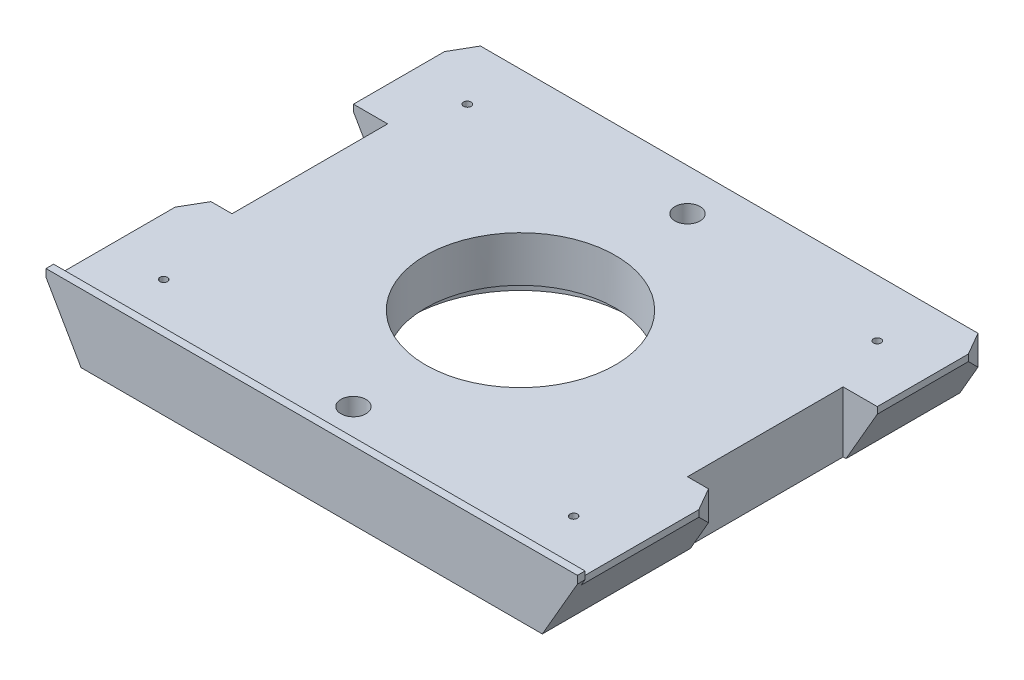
ISO-10303-21;
HEADER;
FILE_DESCRIPTION(('STEP AP214'),'2;1');
FILE_NAME('part.step','',(''),(''),'','','');
FILE_SCHEMA(('AUTOMOTIVE_DESIGN { 1 0 10303 214 1 1 1 1 }'));
ENDSEC;
DATA;
#1=APPLICATION_CONTEXT('core data for automotive mechanical design processes');
#2=APPLICATION_PROTOCOL_DEFINITION('international standard','automotive_design',2000,#1);
#3=PRODUCT_CONTEXT('',#1,'mechanical');
#4=PRODUCT('Part','Part','',(#3));
#5=PRODUCT_RELATED_PRODUCT_CATEGORY('part','',(#4));
#6=PRODUCT_DEFINITION_FORMATION('','',#4);
#7=PRODUCT_DEFINITION_CONTEXT('part definition',#1,'design');
#8=PRODUCT_DEFINITION('design','',#6,#7);
#9=PRODUCT_DEFINITION_SHAPE('','',#8);
#10=(LENGTH_UNIT() NAMED_UNIT(*) SI_UNIT(.MILLI.,.METRE.));
#11=(NAMED_UNIT(*) PLANE_ANGLE_UNIT() SI_UNIT($,.RADIAN.));
#12=(NAMED_UNIT(*) SI_UNIT($,.STERADIAN.) SOLID_ANGLE_UNIT());
#13=UNCERTAINTY_MEASURE_WITH_UNIT(LENGTH_MEASURE(1.E-05),#10,'distance_accuracy_value','');
#14=(GEOMETRIC_REPRESENTATION_CONTEXT(3) GLOBAL_UNCERTAINTY_ASSIGNED_CONTEXT((#13)) GLOBAL_UNIT_ASSIGNED_CONTEXT((#10,
#11,#12)) REPRESENTATION_CONTEXT('',''));
#15=CARTESIAN_POINT('',(0.,0.,0.));
#16=DIRECTION('',(0.,0.,1.));
#17=DIRECTION('',(1.,0.,0.));
#18=AXIS2_PLACEMENT_3D('',#15,#16,#17);
#19=CARTESIAN_POINT('',(0.,-4.,0.));
#20=DIRECTION('',(0.,1.,0.));
#21=DIRECTION('',(0.,0.,1.));
#22=AXIS2_PLACEMENT_3D('',#19,#20,#21);
#23=CYLINDRICAL_SURFACE('',#22,12.5);
#24=CARTESIAN_POINT('',(0.,4.,0.));
#25=DIRECTION('',(0.,1.,0.));
#26=DIRECTION('',(0.,0.,1.));
#27=AXIS2_PLACEMENT_3D('',#24,#25,#26);
#28=CIRCLE('',#27,12.5);
#29=CARTESIAN_POINT('',(0.,4.,12.5));
#30=VERTEX_POINT('',#29);
#31=EDGE_CURVE('E370',#30,#30,#28,.T.);
#32=ORIENTED_EDGE('',*,*,#31,.T.);
#33=EDGE_LOOP('',(#32));
#34=FACE_BOUND('',#33,.T.);
#35=CARTESIAN_POINT('',(0.,-2.,0.));
#36=DIRECTION('',(0.,-1.,0.));
#37=DIRECTION('',(0.,0.,-1.));
#38=AXIS2_PLACEMENT_3D('',#35,#36,#37);
#39=CIRCLE('',#38,12.5);
#40=CARTESIAN_POINT('',(0.,-2.,-12.5));
#41=VERTEX_POINT('',#40);
#42=EDGE_CURVE('E367',#41,#41,#39,.F.);
#43=ORIENTED_EDGE('',*,*,#42,.F.);
#44=EDGE_LOOP('',(#43));
#45=FACE_BOUND('',#44,.T.);
#46=ADVANCED_FACE('F50',(#34,#45),#23,.F.);
#47=CARTESIAN_POINT('',(30.3811978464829,-4.,-27.5));
#48=DIRECTION('',(-0.866025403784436,0.500000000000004,0.));
#49=DIRECTION('',(-0.500000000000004,-0.866025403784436,0.));
#50=AXIS2_PLACEMENT_3D('',#47,#48,#49);
#51=PLANE('',#50);
#52=DIRECTION('',(0.500000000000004,0.866025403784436,0.));
#53=VECTOR('',#52,1.);
#54=CARTESIAN_POINT('',(30.3811978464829,-4.00000000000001,8.));
#55=LINE('',#54,#53);
#56=CARTESIAN_POINT('',(30.3811978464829,-4.,8.));
#57=VERTEX_POINT('',#56);
#58=CARTESIAN_POINT('',(32.7679491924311,0.133974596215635,8.));
#59=VERTEX_POINT('',#58);
#60=EDGE_CURVE('E257',#57,#59,#55,.T.);
#61=ORIENTED_EDGE('',*,*,#60,.T.);
#62=DIRECTION('',(0.377964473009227,0.65465367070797,0.654653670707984));
#63=VECTOR('',#62,1.);
#64=CARTESIAN_POINT('',(22.6201193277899,-17.4425823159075,-9.57655691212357));
#65=LINE('',#64,#63);
#66=CARTESIAN_POINT('',(34.5,3.13397459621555,11.));
#67=VERTEX_POINT('',#66);
#68=EDGE_CURVE('E65',#59,#67,#65,.T.);
#69=ORIENTED_EDGE('',*,*,#68,.T.);
#70=DIRECTION('',(0.,0.,1.));
#71=VECTOR('',#70,1.);
#72=CARTESIAN_POINT('',(34.5,3.13397459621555,-28.5));
#73=LINE('',#72,#71);
#74=CARTESIAN_POINT('',(34.5,3.13397459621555,26.5));
#75=VERTEX_POINT('',#74);
#76=EDGE_CURVE('E326',#67,#75,#73,.T.);
#77=ORIENTED_EDGE('',*,*,#76,.T.);
#78=DIRECTION('',(-0.499999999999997,-0.86602540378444,0.));
#79=VECTOR('',#78,1.);
#80=CARTESIAN_POINT('',(34.5,3.13397459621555,26.5));
#81=LINE('',#80,#79);
#82=CARTESIAN_POINT('',(35.,4.,26.5));
#83=VERTEX_POINT('',#82);
#84=EDGE_CURVE('E320',#83,#75,#81,.T.);
#85=ORIENTED_EDGE('',*,*,#84,.F.);
#86=DIRECTION('',(0.,0.,-1.));
#87=VECTOR('',#86,1.);
#88=CARTESIAN_POINT('',(35.,4.,27.5));
#89=LINE('',#88,#87);
#90=CARTESIAN_POINT('',(35.,4.,27.5));
#91=VERTEX_POINT('',#90);
#92=EDGE_CURVE('E349',#91,#83,#89,.T.);
#93=ORIENTED_EDGE('',*,*,#92,.F.);
#94=DIRECTION('',(-0.500000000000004,-0.866025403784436,0.));
#95=VECTOR('',#94,1.);
#96=CARTESIAN_POINT('',(30.3811978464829,-4.,27.5));
#97=LINE('',#96,#95);
#98=CARTESIAN_POINT('',(30.3811978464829,-4.,27.5));
#99=VERTEX_POINT('',#98);
#100=EDGE_CURVE('E465',#91,#99,#97,.T.);
#101=ORIENTED_EDGE('',*,*,#100,.T.);
#102=DIRECTION('',(0.,0.,1.));
#103=VECTOR('',#102,1.);
#104=CARTESIAN_POINT('',(30.3811978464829,-4.,-27.5));
#105=LINE('',#104,#103);
#106=EDGE_CURVE('E447',#57,#99,#105,.T.);
#107=ORIENTED_EDGE('',*,*,#106,.F.);
#108=EDGE_LOOP('',(#61,#69,#77,#85,#93,#101,#107));
#109=FACE_BOUND('',#108,.T.);
#110=ADVANCED_FACE('F444',(#109),#51,.F.);
#111=CARTESIAN_POINT('',(34.5,4.,-28.5));
#112=DIRECTION('',(1.,0.,0.));
#113=DIRECTION('',(0.,0.,-1.));
#114=AXIS2_PLACEMENT_3D('',#111,#112,#113);
#115=PLANE('',#114);
#116=DIRECTION('',(0.,1.,0.));
#117=VECTOR('',#116,1.);
#118=CARTESIAN_POINT('',(34.5,-4.,11.));
#119=LINE('',#118,#117);
#120=CARTESIAN_POINT('',(34.5,4.,11.));
#121=VERTEX_POINT('',#120);
#122=EDGE_CURVE('E234',#67,#121,#119,.T.);
#123=ORIENTED_EDGE('',*,*,#122,.T.);
#124=DIRECTION('',(0.,0.,1.));
#125=VECTOR('',#124,1.);
#126=CARTESIAN_POINT('',(34.5,4.,-28.5));
#127=LINE('',#126,#125);
#128=CARTESIAN_POINT('',(34.5,4.,26.5));
#129=VERTEX_POINT('',#128);
#130=EDGE_CURVE('E233',#121,#129,#127,.T.);
#131=ORIENTED_EDGE('',*,*,#130,.T.);
#132=DIRECTION('',(0.,1.,0.));
#133=VECTOR('',#132,1.);
#134=CARTESIAN_POINT('',(34.5,4.,26.5));
#135=LINE('',#134,#133);
#136=EDGE_CURVE('E321',#75,#129,#135,.T.);
#137=ORIENTED_EDGE('',*,*,#136,.F.);
#138=ORIENTED_EDGE('',*,*,#76,.F.);
#139=EDGE_LOOP('',(#123,#131,#137,#138));
#140=FACE_BOUND('',#139,.T.);
#141=ADVANCED_FACE('F441',(#140),#115,.T.);
#142=CARTESIAN_POINT('',(-35.,4.,-27.5));
#143=DIRECTION('',(0.866025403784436,0.500000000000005,0.));
#144=DIRECTION('',(-0.500000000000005,0.866025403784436,0.));
#145=AXIS2_PLACEMENT_3D('',#142,#143,#144);
#146=PLANE('',#145);
#147=DIRECTION('',(0.,0.,1.));
#148=VECTOR('',#147,1.);
#149=CARTESIAN_POINT('',(-34.5,3.13397459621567,-28.5));
#150=LINE('',#149,#148);
#151=CARTESIAN_POINT('',(-34.5,3.13397459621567,-24.5));
#152=VERTEX_POINT('',#151);
#153=CARTESIAN_POINT('',(-34.5,3.13397459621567,-12.5));
#154=VERTEX_POINT('',#153);
#155=EDGE_CURVE('E315',#152,#154,#150,.T.);
#156=ORIENTED_EDGE('',*,*,#155,.F.);
#157=DIRECTION('',(0.377964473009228,-0.654653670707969,-0.654653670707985));
#158=VECTOR('',#157,1.);
#159=CARTESIAN_POINT('',(-34.0434067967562,2.34313196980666,-25.2908426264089));
#160=LINE('',#159,#158);
#161=CARTESIAN_POINT('',(-32.7679491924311,0.13397459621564,-27.5));
#162=VERTEX_POINT('',#161);
#163=EDGE_CURVE('E422',#152,#162,#160,.T.);
#164=ORIENTED_EDGE('',*,*,#163,.T.);
#165=DIRECTION('',(-0.500000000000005,0.866025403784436,0.));
#166=VECTOR('',#165,1.);
#167=CARTESIAN_POINT('',(-35.,4.,-27.5));
#168=LINE('',#167,#166);
#169=CARTESIAN_POINT('',(-30.3811978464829,-4.,-27.5));
#170=VERTEX_POINT('',#169);
#171=EDGE_CURVE('E461',#170,#162,#168,.T.);
#172=ORIENTED_EDGE('',*,*,#171,.F.);
#173=DIRECTION('',(0.,0.,1.));
#174=VECTOR('',#173,1.);
#175=CARTESIAN_POINT('',(-30.3811978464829,-4.,-27.5));
#176=LINE('',#175,#174);
#177=CARTESIAN_POINT('',(-30.3811978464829,-4.,-12.5));
#178=VERTEX_POINT('',#177);
#179=EDGE_CURVE('E470',#170,#178,#176,.T.);
#180=ORIENTED_EDGE('',*,*,#179,.T.);
#181=DIRECTION('',(-0.500000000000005,0.866025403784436,0.));
#182=VECTOR('',#181,1.);
#183=CARTESIAN_POINT('',(-35.,4.,-12.5));
#184=LINE('',#183,#182);
#185=EDGE_CURVE('E283',#178,#154,#184,.T.);
#186=ORIENTED_EDGE('',*,*,#185,.T.);
#187=EDGE_LOOP('',(#156,#164,#172,#180,#186));
#188=FACE_BOUND('',#187,.T.);
#189=ADVANCED_FACE('F512',(#188),#146,.F.);
#190=CARTESIAN_POINT('',(-34.5,4.,-28.5));
#191=DIRECTION('',(-1.,0.,0.));
#192=DIRECTION('',(0.,0.,1.));
#193=AXIS2_PLACEMENT_3D('',#190,#191,#192);
#194=PLANE('',#193);
#195=DIRECTION('',(0.,1.,0.));
#196=VECTOR('',#195,1.);
#197=CARTESIAN_POINT('',(-34.5,-4.,-24.5));
#198=LINE('',#197,#196);
#199=CARTESIAN_POINT('',(-34.5,4.,-24.5));
#200=VERTEX_POINT('',#199);
#201=EDGE_CURVE('E425',#152,#200,#198,.T.);
#202=ORIENTED_EDGE('',*,*,#201,.F.);
#203=ORIENTED_EDGE('',*,*,#155,.T.);
#204=DIRECTION('',(0.,-1.,0.));
#205=VECTOR('',#204,1.);
#206=CARTESIAN_POINT('',(-34.5,4.,-12.5));
#207=LINE('',#206,#205);
#208=CARTESIAN_POINT('',(-34.5,4.,-12.5));
#209=VERTEX_POINT('',#208);
#210=EDGE_CURVE('E359',#209,#154,#207,.T.);
#211=ORIENTED_EDGE('',*,*,#210,.F.);
#212=DIRECTION('',(0.,0.,1.));
#213=VECTOR('',#212,1.);
#214=CARTESIAN_POINT('',(-34.5,4.,-28.5));
#215=LINE('',#214,#213);
#216=EDGE_CURVE('E318',#200,#209,#215,.T.);
#217=ORIENTED_EDGE('',*,*,#216,.F.);
#218=EDGE_LOOP('',(#202,#203,#211,#217));
#219=FACE_BOUND('',#218,.T.);
#220=ADVANCED_FACE('F519',(#219),#194,.T.);
#221=CARTESIAN_POINT('',(35.,4.,27.5));
#222=DIRECTION('',(0.,-1.,0.));
#223=DIRECTION('',(0.,0.,-1.));
#224=AXIS2_PLACEMENT_3D('',#221,#222,#223);
#225=PLANE('',#224);
#226=CARTESIAN_POINT('',(0.,4.,-22.));
#227=DIRECTION('',(0.,1.,0.));
#228=DIRECTION('',(0.,0.,1.));
#229=AXIS2_PLACEMENT_3D('',#226,#227,#228);
#230=CIRCLE('',#229,1.64999999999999);
#231=CARTESIAN_POINT('',(0.,4.,-20.35));
#232=VERTEX_POINT('',#231);
#233=EDGE_CURVE('E419',#232,#232,#230,.T.);
#234=ORIENTED_EDGE('',*,*,#233,.F.);
#235=EDGE_LOOP('',(#234));
#236=FACE_BOUND('',#235,.T.);
#237=CARTESIAN_POINT('',(0.,4.,22.));
#238=DIRECTION('',(0.,1.,0.));
#239=DIRECTION('',(0.,0.,1.));
#240=AXIS2_PLACEMENT_3D('',#237,#238,#239);
#241=CIRCLE('',#240,1.64999999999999);
#242=CARTESIAN_POINT('',(0.,4.,23.65));
#243=VERTEX_POINT('',#242);
#244=EDGE_CURVE('E413',#243,#243,#241,.T.);
#245=ORIENTED_EDGE('',*,*,#244,.F.);
#246=EDGE_LOOP('',(#245));
#247=FACE_BOUND('',#246,.T.);
#248=ORIENTED_EDGE('',*,*,#31,.F.);
#249=EDGE_LOOP('',(#248));
#250=FACE_BOUND('',#249,.T.);
#251=CARTESIAN_POINT('',(-27.,4.,-20.));
#252=DIRECTION('',(0.,1.,0.));
#253=DIRECTION('',(0.,0.,1.));
#254=AXIS2_PLACEMENT_3D('',#251,#252,#253);
#255=CIRCLE('',#254,0.5);
#256=CARTESIAN_POINT('',(-27.,4.,-19.5));
#257=VERTEX_POINT('',#256);
#258=EDGE_CURVE('E286',#257,#257,#255,.T.);
#259=ORIENTED_EDGE('',*,*,#258,.F.);
#260=EDGE_LOOP('',(#259));
#261=FACE_BOUND('',#260,.T.);
#262=CARTESIAN_POINT('',(27.,4.,-20.));
#263=DIRECTION('',(0.,1.,0.));
#264=DIRECTION('',(0.,0.,1.));
#265=AXIS2_PLACEMENT_3D('',#262,#263,#264);
#266=CIRCLE('',#265,0.5);
#267=CARTESIAN_POINT('',(27.,4.,-19.5));
#268=VERTEX_POINT('',#267);
#269=EDGE_CURVE('E292',#268,#268,#266,.T.);
#270=ORIENTED_EDGE('',*,*,#269,.F.);
#271=EDGE_LOOP('',(#270));
#272=FACE_BOUND('',#271,.T.);
#273=CARTESIAN_POINT('',(27.,4.,20.));
#274=DIRECTION('',(0.,1.,0.));
#275=DIRECTION('',(0.,0.,1.));
#276=AXIS2_PLACEMENT_3D('',#273,#274,#275);
#277=CIRCLE('',#276,0.5);
#278=CARTESIAN_POINT('',(27.,4.,20.5));
#279=VERTEX_POINT('',#278);
#280=EDGE_CURVE('E298',#279,#279,#277,.T.);
#281=ORIENTED_EDGE('',*,*,#280,.F.);
#282=EDGE_LOOP('',(#281));
#283=FACE_BOUND('',#282,.T.);
#284=CARTESIAN_POINT('',(-27.,4.,20.));
#285=DIRECTION('',(0.,1.,0.));
#286=DIRECTION('',(0.,0.,1.));
#287=AXIS2_PLACEMENT_3D('',#284,#285,#286);
#288=CIRCLE('',#287,0.5);
#289=CARTESIAN_POINT('',(-27.,4.,20.5));
#290=VERTEX_POINT('',#289);
#291=EDGE_CURVE('E304',#290,#290,#288,.T.);
#292=ORIENTED_EDGE('',*,*,#291,.F.);
#293=EDGE_LOOP('',(#292));
#294=FACE_BOUND('',#293,.T.);
#295=ORIENTED_EDGE('',*,*,#130,.F.);
#296=DIRECTION('',(0.499999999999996,0.,0.866025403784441));
#297=VECTOR('',#296,1.);
#298=CARTESIAN_POINT('',(32.7679491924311,4.,8.));
#299=LINE('',#298,#297);
#300=CARTESIAN_POINT('',(32.7679491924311,4.,8.));
#301=VERTEX_POINT('',#300);
#302=EDGE_CURVE('E221',#301,#121,#299,.T.);
#303=ORIENTED_EDGE('',*,*,#302,.F.);
#304=DIRECTION('',(1.,0.,0.));
#305=VECTOR('',#304,1.);
#306=CARTESIAN_POINT('',(34.5,4.,8.));
#307=LINE('',#306,#305);
#308=CARTESIAN_POINT('',(30.,4.,8.));
#309=VERTEX_POINT('',#308);
#310=EDGE_CURVE('E231',#309,#301,#307,.T.);
#311=ORIENTED_EDGE('',*,*,#310,.F.);
#312=DIRECTION('',(0.,0.,1.));
#313=VECTOR('',#312,1.);
#314=CARTESIAN_POINT('',(30.,4.,-12.5));
#315=LINE('',#314,#313);
#316=CARTESIAN_POINT('',(30.,4.,-12.5));
#317=VERTEX_POINT('',#316);
#318=EDGE_CURVE('E241',#317,#309,#315,.T.);
#319=ORIENTED_EDGE('',*,*,#318,.F.);
#320=DIRECTION('',(-1.,0.,0.));
#321=VECTOR('',#320,1.);
#322=CARTESIAN_POINT('',(34.5,4.,-12.5));
#323=LINE('',#322,#321);
#324=CARTESIAN_POINT('',(34.5,4.,-12.5));
#325=VERTEX_POINT('',#324);
#326=EDGE_CURVE('E246',#325,#317,#323,.T.);
#327=ORIENTED_EDGE('',*,*,#326,.F.);
#328=CARTESIAN_POINT('',(34.5,4.,-24.5));
#329=VERTEX_POINT('',#328);
#330=EDGE_CURVE('E324',#329,#325,#127,.T.);
#331=ORIENTED_EDGE('',*,*,#330,.F.);
#332=DIRECTION('',(0.499999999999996,0.,0.866025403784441));
#333=VECTOR('',#332,1.);
#334=CARTESIAN_POINT('',(32.7679491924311,4.,-27.5));
#335=LINE('',#334,#333);
#336=CARTESIAN_POINT('',(32.7679491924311,4.,-27.5));
#337=VERTEX_POINT('',#336);
#338=EDGE_CURVE('E72',#337,#329,#335,.T.);
#339=ORIENTED_EDGE('',*,*,#338,.F.);
#340=DIRECTION('',(-1.,0.,0.));
#341=VECTOR('',#340,1.);
#342=CARTESIAN_POINT('',(35.,4.,-27.5));
#343=LINE('',#342,#341);
#344=CARTESIAN_POINT('',(-32.7679491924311,4.,-27.5));
#345=VERTEX_POINT('',#344);
#346=EDGE_CURVE('E363',#337,#345,#343,.T.);
#347=ORIENTED_EDGE('',*,*,#346,.T.);
#348=DIRECTION('',(0.499999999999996,0.,-0.866025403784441));
#349=VECTOR('',#348,1.);
#350=CARTESIAN_POINT('',(-34.5,4.,-24.5));
#351=LINE('',#350,#349);
#352=EDGE_CURVE('E427',#200,#345,#351,.T.);
#353=ORIENTED_EDGE('',*,*,#352,.F.);
#354=ORIENTED_EDGE('',*,*,#216,.T.);
#355=DIRECTION('',(-1.,0.,0.));
#356=VECTOR('',#355,1.);
#357=CARTESIAN_POINT('',(-34.5,4.,-12.5));
#358=LINE('',#357,#356);
#359=CARTESIAN_POINT('',(-30.,4.,-12.5));
#360=VERTEX_POINT('',#359);
#361=EDGE_CURVE('E264',#360,#209,#358,.T.);
#362=ORIENTED_EDGE('',*,*,#361,.F.);
#363=DIRECTION('',(0.,0.,-1.));
#364=VECTOR('',#363,1.);
#365=CARTESIAN_POINT('',(-30.,4.,-12.5));
#366=LINE('',#365,#364);
#367=CARTESIAN_POINT('',(-30.,4.,8.));
#368=VERTEX_POINT('',#367);
#369=EDGE_CURVE('E272',#368,#360,#366,.T.);
#370=ORIENTED_EDGE('',*,*,#369,.F.);
#371=DIRECTION('',(1.,0.,0.));
#372=VECTOR('',#371,1.);
#373=CARTESIAN_POINT('',(-34.5,4.,8.));
#374=LINE('',#373,#372);
#375=CARTESIAN_POINT('',(-32.7679491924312,4.,8.));
#376=VERTEX_POINT('',#375);
#377=EDGE_CURVE('E259',#376,#368,#374,.T.);
#378=ORIENTED_EDGE('',*,*,#377,.F.);
#379=DIRECTION('',(0.499999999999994,0.,-0.866025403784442));
#380=VECTOR('',#379,1.);
#381=CARTESIAN_POINT('',(-32.7679491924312,4.,8.));
#382=LINE('',#381,#380);
#383=CARTESIAN_POINT('',(-34.5,4.,11.));
#384=VERTEX_POINT('',#383);
#385=EDGE_CURVE('E389',#384,#376,#382,.T.);
#386=ORIENTED_EDGE('',*,*,#385,.F.);
#387=CARTESIAN_POINT('',(-34.5,4.,26.5));
#388=VERTEX_POINT('',#387);
#389=EDGE_CURVE('E317',#384,#388,#215,.T.);
#390=ORIENTED_EDGE('',*,*,#389,.T.);
#391=DIRECTION('',(-1.,0.,0.));
#392=VECTOR('',#391,1.);
#393=CARTESIAN_POINT('',(-35.,4.,26.5));
#394=LINE('',#393,#392);
#395=EDGE_CURVE('E334',#129,#388,#394,.T.);
#396=ORIENTED_EDGE('',*,*,#395,.F.);
#397=EDGE_LOOP('',(#295,#303,#311,#319,#327,#331,#339,#347,#353,#354,#362,#370,#378,#386,#390,#396));
#398=FACE_BOUND('',#397,.T.);
#399=ADVANCED_FACE('F229',(#236,#247,#250,#261,#272,#283,#294,#398),#225,.F.);
#400=CARTESIAN_POINT('',(35.,-4.,-27.5));
#401=DIRECTION('',(0.,0.,1.));
#402=DIRECTION('',(1.,0.,0.));
#403=AXIS2_PLACEMENT_3D('',#400,#401,#402);
#404=PLANE('',#403);
#405=ORIENTED_EDGE('',*,*,#346,.F.);
#406=DIRECTION('',(0.,1.,0.));
#407=VECTOR('',#406,1.);
#408=CARTESIAN_POINT('',(32.7679491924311,-4.,-27.5));
#409=LINE('',#408,#407);
#410=CARTESIAN_POINT('',(32.7679491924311,0.133974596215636,-27.5));
#411=VERTEX_POINT('',#410);
#412=EDGE_CURVE('E390',#411,#337,#409,.T.);
#413=ORIENTED_EDGE('',*,*,#412,.F.);
#414=DIRECTION('',(-0.500000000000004,-0.866025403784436,0.));
#415=VECTOR('',#414,1.);
#416=CARTESIAN_POINT('',(30.3811978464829,-4.,-27.5));
#417=LINE('',#416,#415);
#418=CARTESIAN_POINT('',(30.3811978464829,-4.,-27.5));
#419=VERTEX_POINT('',#418);
#420=EDGE_CURVE('E388',#411,#419,#417,.T.);
#421=ORIENTED_EDGE('',*,*,#420,.T.);
#422=DIRECTION('',(-1.,0.,0.));
#423=VECTOR('',#422,1.);
#424=CARTESIAN_POINT('',(35.,-4.,-27.5));
#425=LINE('',#424,#423);
#426=EDGE_CURVE('E458',#419,#170,#425,.T.);
#427=ORIENTED_EDGE('',*,*,#426,.T.);
#428=ORIENTED_EDGE('',*,*,#171,.T.);
#429=DIRECTION('',(0.,1.,0.));
#430=VECTOR('',#429,1.);
#431=CARTESIAN_POINT('',(-32.7679491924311,-4.,-27.5));
#432=LINE('',#431,#430);
#433=EDGE_CURVE('E366',#162,#345,#432,.T.);
#434=ORIENTED_EDGE('',*,*,#433,.T.);
#435=EDGE_LOOP('',(#405,#413,#421,#427,#428,#434));
#436=FACE_BOUND('',#435,.T.);
#437=ADVANCED_FACE('F52',(#436),#404,.F.);
#438=CARTESIAN_POINT('',(-34.5,3.13397459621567,11.));
#439=VERTEX_POINT('',#438);
#440=CARTESIAN_POINT('',(-34.5,3.13397459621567,26.5));
#441=VERTEX_POINT('',#440);
#442=EDGE_CURVE('E314',#439,#441,#150,.T.);
#443=ORIENTED_EDGE('',*,*,#442,.F.);
#444=DIRECTION('',(0.377964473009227,-0.654653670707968,-0.654653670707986));
#445=VECTOR('',#444,1.);
#446=CARTESIAN_POINT('',(-25.2594348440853,-12.8711537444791,-5.00512834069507));
#447=LINE('',#446,#445);
#448=CARTESIAN_POINT('',(-32.7679491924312,0.133974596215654,8.));
#449=VERTEX_POINT('',#448);
#450=EDGE_CURVE('E430',#439,#449,#447,.T.);
#451=ORIENTED_EDGE('',*,*,#450,.T.);
#452=DIRECTION('',(0.500000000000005,-0.866025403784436,0.));
#453=VECTOR('',#452,1.);
#454=CARTESIAN_POINT('',(-35.,4.,8.));
#455=LINE('',#454,#453);
#456=CARTESIAN_POINT('',(-30.3811978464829,-4.,8.));
#457=VERTEX_POINT('',#456);
#458=EDGE_CURVE('E279',#449,#457,#455,.T.);
#459=ORIENTED_EDGE('',*,*,#458,.T.);
#460=CARTESIAN_POINT('',(-30.3811978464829,-4.,27.5));
#461=VERTEX_POINT('',#460);
#462=EDGE_CURVE('E468',#457,#461,#176,.T.);
#463=ORIENTED_EDGE('',*,*,#462,.T.);
#464=DIRECTION('',(-0.500000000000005,0.866025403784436,0.));
#465=VECTOR('',#464,1.);
#466=CARTESIAN_POINT('',(-35.,4.,27.5));
#467=LINE('',#466,#465);
#468=CARTESIAN_POINT('',(-35.,4.,27.5));
#469=VERTEX_POINT('',#468);
#470=EDGE_CURVE('E459',#461,#469,#467,.T.);
#471=ORIENTED_EDGE('',*,*,#470,.T.);
#472=DIRECTION('',(0.,0.,1.));
#473=VECTOR('',#472,1.);
#474=CARTESIAN_POINT('',(-35.,4.,27.5));
#475=LINE('',#474,#473);
#476=CARTESIAN_POINT('',(-35.,4.,26.5));
#477=VERTEX_POINT('',#476);
#478=EDGE_CURVE('E329',#477,#469,#475,.T.);
#479=ORIENTED_EDGE('',*,*,#478,.F.);
#480=DIRECTION('',(-0.500000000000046,0.866025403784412,0.));
#481=VECTOR('',#480,1.);
#482=CARTESIAN_POINT('',(-34.5,3.13397459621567,26.5));
#483=LINE('',#482,#481);
#484=EDGE_CURVE('E310',#441,#477,#483,.T.);
#485=ORIENTED_EDGE('',*,*,#484,.F.);
#486=EDGE_LOOP('',(#443,#451,#459,#463,#471,#479,#485));
#487=FACE_BOUND('',#486,.T.);
#488=ADVANCED_FACE('F536',(#487),#146,.F.);
#489=CARTESIAN_POINT('',(35.,-4.,27.5));
#490=DIRECTION('',(0.,0.,-1.));
#491=DIRECTION('',(-1.,0.,0.));
#492=AXIS2_PLACEMENT_3D('',#489,#490,#491);
#493=PLANE('',#492);
#494=DIRECTION('',(-1.,0.,0.));
#495=VECTOR('',#494,1.);
#496=CARTESIAN_POINT('',(35.,-4.,27.5));
#497=LINE('',#496,#495);
#498=EDGE_CURVE('E474',#99,#461,#497,.T.);
#499=ORIENTED_EDGE('',*,*,#498,.F.);
#500=ORIENTED_EDGE('',*,*,#100,.F.);
#501=DIRECTION('',(0.,-1.,0.));
#502=VECTOR('',#501,1.);
#503=CARTESIAN_POINT('',(35.,5.,27.5));
#504=LINE('',#503,#502);
#505=CARTESIAN_POINT('',(35.,5.,27.5));
#506=VERTEX_POINT('',#505);
#507=EDGE_CURVE('E343',#506,#91,#504,.T.);
#508=ORIENTED_EDGE('',*,*,#507,.F.);
#509=DIRECTION('',(1.,0.,0.));
#510=VECTOR('',#509,1.);
#511=CARTESIAN_POINT('',(-35.,5.,27.5));
#512=LINE('',#511,#510);
#513=CARTESIAN_POINT('',(-35.,5.,27.5));
#514=VERTEX_POINT('',#513);
#515=EDGE_CURVE('E333',#514,#506,#512,.T.);
#516=ORIENTED_EDGE('',*,*,#515,.F.);
#517=DIRECTION('',(0.,-1.,0.));
#518=VECTOR('',#517,1.);
#519=CARTESIAN_POINT('',(-35.,5.,27.5));
#520=LINE('',#519,#518);
#521=EDGE_CURVE('E494',#514,#469,#520,.T.);
#522=ORIENTED_EDGE('',*,*,#521,.T.);
#523=ORIENTED_EDGE('',*,*,#470,.F.);
#524=EDGE_LOOP('',(#499,#500,#508,#516,#522,#523));
#525=FACE_BOUND('',#524,.T.);
#526=ADVANCED_FACE('F551',(#525),#493,.F.);
#527=CARTESIAN_POINT('',(35.,-4.,27.5));
#528=DIRECTION('',(0.,1.,0.));
#529=DIRECTION('',(0.,0.,1.));
#530=AXIS2_PLACEMENT_3D('',#527,#528,#529);
#531=PLANE('',#530);
#532=CARTESIAN_POINT('',(0.,-4.,-22.));
#533=DIRECTION('',(0.,1.,0.));
#534=DIRECTION('',(0.,0.,1.));
#535=AXIS2_PLACEMENT_3D('',#532,#533,#534);
#536=CIRCLE('',#535,1.65);
#537=CARTESIAN_POINT('',(0.,-4.,-20.35));
#538=VERTEX_POINT('',#537);
#539=EDGE_CURVE('E416',#538,#538,#536,.T.);
#540=ORIENTED_EDGE('',*,*,#539,.T.);
#541=EDGE_LOOP('',(#540));
#542=FACE_BOUND('',#541,.T.);
#543=CARTESIAN_POINT('',(0.,-4.,22.));
#544=DIRECTION('',(0.,1.,0.));
#545=DIRECTION('',(0.,0.,1.));
#546=AXIS2_PLACEMENT_3D('',#543,#544,#545);
#547=CIRCLE('',#546,1.65);
#548=CARTESIAN_POINT('',(0.,-4.,23.65));
#549=VERTEX_POINT('',#548);
#550=EDGE_CURVE('E408',#549,#549,#547,.T.);
#551=ORIENTED_EDGE('',*,*,#550,.T.);
#552=EDGE_LOOP('',(#551));
#553=FACE_BOUND('',#552,.T.);
#554=CARTESIAN_POINT('',(0.,-4.,0.));
#555=DIRECTION('',(0.,-1.,0.));
#556=DIRECTION('',(0.,0.,-1.));
#557=AXIS2_PLACEMENT_3D('',#554,#555,#556);
#558=CIRCLE('',#557,14.5);
#559=CARTESIAN_POINT('',(0.,-4.,-14.5));
#560=VERTEX_POINT('',#559);
#561=EDGE_CURVE('E405',#560,#560,#558,.T.);
#562=ORIENTED_EDGE('',*,*,#561,.F.);
#563=EDGE_LOOP('',(#562));
#564=FACE_BOUND('',#563,.T.);
#565=DIRECTION('',(0.,0.,1.));
#566=VECTOR('',#565,1.);
#567=CARTESIAN_POINT('',(30.,-4.,-12.5));
#568=LINE('',#567,#566);
#569=CARTESIAN_POINT('',(30.,-4.,-12.5));
#570=VERTEX_POINT('',#569);
#571=CARTESIAN_POINT('',(30.,-4.,8.));
#572=VERTEX_POINT('',#571);
#573=EDGE_CURVE('E244',#570,#572,#568,.T.);
#574=ORIENTED_EDGE('',*,*,#573,.T.);
#575=DIRECTION('',(1.,0.,0.));
#576=VECTOR('',#575,1.);
#577=CARTESIAN_POINT('',(34.5,-4.,8.));
#578=LINE('',#577,#576);
#579=EDGE_CURVE('E254',#572,#57,#578,.T.);
#580=ORIENTED_EDGE('',*,*,#579,.T.);
#581=ORIENTED_EDGE('',*,*,#106,.T.);
#582=ORIENTED_EDGE('',*,*,#498,.T.);
#583=ORIENTED_EDGE('',*,*,#462,.F.);
#584=DIRECTION('',(1.,0.,0.));
#585=VECTOR('',#584,1.);
#586=CARTESIAN_POINT('',(-34.5,-4.,8.));
#587=LINE('',#586,#585);
#588=CARTESIAN_POINT('',(-30.,-4.,8.));
#589=VERTEX_POINT('',#588);
#590=EDGE_CURVE('E260',#457,#589,#587,.T.);
#591=ORIENTED_EDGE('',*,*,#590,.T.);
#592=DIRECTION('',(0.,0.,-1.));
#593=VECTOR('',#592,1.);
#594=CARTESIAN_POINT('',(-30.,-4.,-12.5));
#595=LINE('',#594,#593);
#596=CARTESIAN_POINT('',(-30.,-4.,-12.5));
#597=VERTEX_POINT('',#596);
#598=EDGE_CURVE('E263',#589,#597,#595,.T.);
#599=ORIENTED_EDGE('',*,*,#598,.T.);
#600=DIRECTION('',(-1.,0.,0.));
#601=VECTOR('',#600,1.);
#602=CARTESIAN_POINT('',(-34.5,-4.,-12.5));
#603=LINE('',#602,#601);
#604=EDGE_CURVE('E267',#597,#178,#603,.T.);
#605=ORIENTED_EDGE('',*,*,#604,.T.);
#606=ORIENTED_EDGE('',*,*,#179,.F.);
#607=ORIENTED_EDGE('',*,*,#426,.F.);
#608=CARTESIAN_POINT('',(30.3811978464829,-4.,-12.5));
#609=VERTEX_POINT('',#608);
#610=EDGE_CURVE('E455',#419,#609,#105,.T.);
#611=ORIENTED_EDGE('',*,*,#610,.T.);
#612=DIRECTION('',(-1.,0.,0.));
#613=VECTOR('',#612,1.);
#614=CARTESIAN_POINT('',(34.5,-4.,-12.5));
#615=LINE('',#614,#613);
#616=EDGE_CURVE('E240',#609,#570,#615,.T.);
#617=ORIENTED_EDGE('',*,*,#616,.T.);
#618=EDGE_LOOP('',(#574,#580,#581,#582,#583,#591,#599,#605,#606,#607,#611,#617));
#619=FACE_BOUND('',#618,.T.);
#620=ADVANCED_FACE('F449',(#542,#553,#564,#619),#531,.F.);
#621=ORIENTED_EDGE('',*,*,#420,.F.);
#622=DIRECTION('',(0.377964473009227,0.65465367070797,0.654653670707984));
#623=VECTOR('',#622,1.);
#624=CARTESIAN_POINT('',(31.4040912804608,-2.22829660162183,-29.8622711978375));
#625=LINE('',#624,#623);
#626=CARTESIAN_POINT('',(34.5,3.13397459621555,-24.5));
#627=VERTEX_POINT('',#626);
#628=EDGE_CURVE('E378',#411,#627,#625,.T.);
#629=ORIENTED_EDGE('',*,*,#628,.T.);
#630=CARTESIAN_POINT('',(34.5,3.13397459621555,-12.5));
#631=VERTEX_POINT('',#630);
#632=EDGE_CURVE('E327',#627,#631,#73,.T.);
#633=ORIENTED_EDGE('',*,*,#632,.T.);
#634=DIRECTION('',(-0.500000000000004,-0.866025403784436,0.));
#635=VECTOR('',#634,1.);
#636=CARTESIAN_POINT('',(30.3811978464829,-4.,-12.5));
#637=LINE('',#636,#635);
#638=EDGE_CURVE('E251',#631,#609,#637,.T.);
#639=ORIENTED_EDGE('',*,*,#638,.T.);
#640=ORIENTED_EDGE('',*,*,#610,.F.);
#641=EDGE_LOOP('',(#621,#629,#633,#639,#640));
#642=FACE_BOUND('',#641,.T.);
#643=ADVANCED_FACE('F385',(#642),#51,.F.);
#644=CARTESIAN_POINT('',(-35.,5.,27.5));
#645=DIRECTION('',(1.,0.,0.));
#646=DIRECTION('',(0.,0.,-1.));
#647=AXIS2_PLACEMENT_3D('',#644,#645,#646);
#648=PLANE('',#647);
#649=ORIENTED_EDGE('',*,*,#478,.T.);
#650=ORIENTED_EDGE('',*,*,#521,.F.);
#651=DIRECTION('',(0.,0.,1.));
#652=VECTOR('',#651,1.);
#653=CARTESIAN_POINT('',(-35.,5.,27.5));
#654=LINE('',#653,#652);
#655=CARTESIAN_POINT('',(-35.,5.,26.5));
#656=VERTEX_POINT('',#655);
#657=EDGE_CURVE('E330',#656,#514,#654,.T.);
#658=ORIENTED_EDGE('',*,*,#657,.F.);
#659=DIRECTION('',(0.,-1.,0.));
#660=VECTOR('',#659,1.);
#661=CARTESIAN_POINT('',(-35.,5.,26.5));
#662=LINE('',#661,#660);
#663=EDGE_CURVE('E340',#656,#477,#662,.T.);
#664=ORIENTED_EDGE('',*,*,#663,.T.);
#665=EDGE_LOOP('',(#649,#650,#658,#664));
#666=FACE_BOUND('',#665,.T.);
#667=ADVANCED_FACE('F553',(#666),#648,.F.);
#668=CARTESIAN_POINT('',(35.,5.,27.5));
#669=DIRECTION('',(-1.,0.,0.));
#670=DIRECTION('',(0.,0.,1.));
#671=AXIS2_PLACEMENT_3D('',#668,#669,#670);
#672=PLANE('',#671);
#673=ORIENTED_EDGE('',*,*,#92,.T.);
#674=DIRECTION('',(0.,-1.,0.));
#675=VECTOR('',#674,1.);
#676=CARTESIAN_POINT('',(35.,5.,26.5));
#677=LINE('',#676,#675);
#678=CARTESIAN_POINT('',(35.,5.,26.5));
#679=VERTEX_POINT('',#678);
#680=EDGE_CURVE('E479',#679,#83,#677,.T.);
#681=ORIENTED_EDGE('',*,*,#680,.F.);
#682=DIRECTION('',(0.,0.,-1.));
#683=VECTOR('',#682,1.);
#684=CARTESIAN_POINT('',(35.,5.,27.5));
#685=LINE('',#684,#683);
#686=EDGE_CURVE('E336',#506,#679,#685,.T.);
#687=ORIENTED_EDGE('',*,*,#686,.F.);
#688=ORIENTED_EDGE('',*,*,#507,.T.);
#689=EDGE_LOOP('',(#673,#681,#687,#688));
#690=FACE_BOUND('',#689,.T.);
#691=ADVANCED_FACE('F546',(#690),#672,.F.);
#692=CARTESIAN_POINT('',(-35.,5.,26.5));
#693=DIRECTION('',(0.,0.,1.));
#694=DIRECTION('',(1.,0.,0.));
#695=AXIS2_PLACEMENT_3D('',#692,#693,#694);
#696=PLANE('',#695);
#697=ORIENTED_EDGE('',*,*,#680,.T.);
#698=ORIENTED_EDGE('',*,*,#84,.T.);
#699=ORIENTED_EDGE('',*,*,#136,.T.);
#700=ORIENTED_EDGE('',*,*,#395,.T.);
#701=DIRECTION('',(0.,-1.,0.));
#702=VECTOR('',#701,1.);
#703=CARTESIAN_POINT('',(-34.5,4.,26.5));
#704=LINE('',#703,#702);
#705=EDGE_CURVE('E311',#388,#441,#704,.T.);
#706=ORIENTED_EDGE('',*,*,#705,.T.);
#707=ORIENTED_EDGE('',*,*,#484,.T.);
#708=ORIENTED_EDGE('',*,*,#663,.F.);
#709=DIRECTION('',(-1.,0.,0.));
#710=VECTOR('',#709,1.);
#711=CARTESIAN_POINT('',(-35.,5.,26.5));
#712=LINE('',#711,#710);
#713=EDGE_CURVE('E338',#679,#656,#712,.T.);
#714=ORIENTED_EDGE('',*,*,#713,.F.);
#715=EDGE_LOOP('',(#697,#698,#699,#700,#706,#707,#708,#714));
#716=FACE_BOUND('',#715,.T.);
#717=ADVANCED_FACE('F543',(#716),#696,.F.);
#718=CARTESIAN_POINT('',(0.,5.,0.));
#719=DIRECTION('',(0.,-1.,0.));
#720=DIRECTION('',(0.,0.,-1.));
#721=AXIS2_PLACEMENT_3D('',#718,#719,#720);
#722=PLANE('',#721);
#723=ORIENTED_EDGE('',*,*,#657,.T.);
#724=ORIENTED_EDGE('',*,*,#515,.T.);
#725=ORIENTED_EDGE('',*,*,#686,.T.);
#726=ORIENTED_EDGE('',*,*,#713,.T.);
#727=EDGE_LOOP('',(#723,#724,#725,#726));
#728=FACE_BOUND('',#727,.T.);
#729=ADVANCED_FACE('F549',(#728),#722,.F.);
#730=DIRECTION('',(0.,-1.,0.));
#731=VECTOR('',#730,1.);
#732=CARTESIAN_POINT('',(34.5,4.,-24.5));
#733=LINE('',#732,#731);
#734=EDGE_CURVE('E58',#329,#627,#733,.T.);
#735=ORIENTED_EDGE('',*,*,#734,.F.);
#736=ORIENTED_EDGE('',*,*,#330,.T.);
#737=DIRECTION('',(0.,1.,0.));
#738=VECTOR('',#737,1.);
#739=CARTESIAN_POINT('',(34.5,4.,-12.5));
#740=LINE('',#739,#738);
#741=EDGE_CURVE('E362',#631,#325,#740,.T.);
#742=ORIENTED_EDGE('',*,*,#741,.F.);
#743=ORIENTED_EDGE('',*,*,#632,.F.);
#744=EDGE_LOOP('',(#735,#736,#742,#743));
#745=FACE_BOUND('',#744,.T.);
#746=ADVANCED_FACE('F393',(#745),#115,.T.);
#747=DIRECTION('',(0.,1.,0.));
#748=VECTOR('',#747,1.);
#749=CARTESIAN_POINT('',(-34.5,-4.,11.));
#750=LINE('',#749,#748);
#751=EDGE_CURVE('E433',#439,#384,#750,.T.);
#752=ORIENTED_EDGE('',*,*,#751,.F.);
#753=ORIENTED_EDGE('',*,*,#442,.T.);
#754=ORIENTED_EDGE('',*,*,#705,.F.);
#755=ORIENTED_EDGE('',*,*,#389,.F.);
#756=EDGE_LOOP('',(#752,#753,#754,#755));
#757=FACE_BOUND('',#756,.T.);
#758=ADVANCED_FACE('F541',(#757),#194,.T.);
#759=CARTESIAN_POINT('',(-27.,2.,20.));
#760=DIRECTION('',(0.,1.,0.));
#761=DIRECTION('',(0.,0.,1.));
#762=AXIS2_PLACEMENT_3D('',#759,#760,#761);
#763=CONICAL_SURFACE('',#762,0.5,1.02974425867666);
#764=CARTESIAN_POINT('',(-27.,1.69956969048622,20.));
#765=VERTEX_POINT('',#764);
#766=VERTEX_LOOP('',#765);
#767=FACE_BOUND('',#766,.T.);
#768=CARTESIAN_POINT('',(-27.,2.,20.));
#769=DIRECTION('',(0.,1.,0.));
#770=DIRECTION('',(0.,0.,1.));
#771=AXIS2_PLACEMENT_3D('',#768,#769,#770);
#772=CIRCLE('',#771,0.5);
#773=CARTESIAN_POINT('',(-27.,2.,20.5));
#774=VERTEX_POINT('',#773);
#775=EDGE_CURVE('E307',#774,#774,#772,.T.);
#776=ORIENTED_EDGE('',*,*,#775,.T.);
#777=EDGE_LOOP('',(#776));
#778=FACE_BOUND('',#777,.T.);
#779=ADVANCED_FACE('F613',(#767,#778),#763,.F.);
#780=CARTESIAN_POINT('',(-27.,4.,20.));
#781=DIRECTION('',(0.,1.,0.));
#782=DIRECTION('',(0.,0.,1.));
#783=AXIS2_PLACEMENT_3D('',#780,#781,#782);
#784=CYLINDRICAL_SURFACE('',#783,0.5);
#785=ORIENTED_EDGE('',*,*,#775,.F.);
#786=EDGE_LOOP('',(#785));
#787=FACE_BOUND('',#786,.T.);
#788=ORIENTED_EDGE('',*,*,#291,.T.);
#789=EDGE_LOOP('',(#788));
#790=FACE_BOUND('',#789,.T.);
#791=ADVANCED_FACE('F609',(#787,#790),#784,.F.);
#792=CARTESIAN_POINT('',(27.,2.,20.));
#793=DIRECTION('',(0.,1.,0.));
#794=DIRECTION('',(0.,0.,1.));
#795=AXIS2_PLACEMENT_3D('',#792,#793,#794);
#796=CONICAL_SURFACE('',#795,0.5,1.02974425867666);
#797=CARTESIAN_POINT('',(27.,1.69956969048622,20.));
#798=VERTEX_POINT('',#797);
#799=VERTEX_LOOP('',#798);
#800=FACE_BOUND('',#799,.T.);
#801=CARTESIAN_POINT('',(27.,2.,20.));
#802=DIRECTION('',(0.,1.,0.));
#803=DIRECTION('',(0.,0.,1.));
#804=AXIS2_PLACEMENT_3D('',#801,#802,#803);
#805=CIRCLE('',#804,0.5);
#806=CARTESIAN_POINT('',(27.,2.,20.5));
#807=VERTEX_POINT('',#806);
#808=EDGE_CURVE('E301',#807,#807,#805,.T.);
#809=ORIENTED_EDGE('',*,*,#808,.T.);
#810=EDGE_LOOP('',(#809));
#811=FACE_BOUND('',#810,.T.);
#812=ADVANCED_FACE('F605',(#800,#811),#796,.F.);
#813=CARTESIAN_POINT('',(27.,4.,20.));
#814=DIRECTION('',(0.,1.,0.));
#815=DIRECTION('',(0.,0.,1.));
#816=AXIS2_PLACEMENT_3D('',#813,#814,#815);
#817=CYLINDRICAL_SURFACE('',#816,0.5);
#818=ORIENTED_EDGE('',*,*,#808,.F.);
#819=EDGE_LOOP('',(#818));
#820=FACE_BOUND('',#819,.T.);
#821=ORIENTED_EDGE('',*,*,#280,.T.);
#822=EDGE_LOOP('',(#821));
#823=FACE_BOUND('',#822,.T.);
#824=ADVANCED_FACE('F601',(#820,#823),#817,.F.);
#825=CARTESIAN_POINT('',(27.,2.,-20.));
#826=DIRECTION('',(0.,1.,0.));
#827=DIRECTION('',(0.,0.,1.));
#828=AXIS2_PLACEMENT_3D('',#825,#826,#827);
#829=CONICAL_SURFACE('',#828,0.5,1.02974425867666);
#830=CARTESIAN_POINT('',(27.,1.69956969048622,-20.));
#831=VERTEX_POINT('',#830);
#832=VERTEX_LOOP('',#831);
#833=FACE_BOUND('',#832,.T.);
#834=CARTESIAN_POINT('',(27.,2.,-20.));
#835=DIRECTION('',(0.,1.,0.));
#836=DIRECTION('',(0.,0.,1.));
#837=AXIS2_PLACEMENT_3D('',#834,#835,#836);
#838=CIRCLE('',#837,0.5);
#839=CARTESIAN_POINT('',(27.,2.,-19.5));
#840=VERTEX_POINT('',#839);
#841=EDGE_CURVE('E295',#840,#840,#838,.T.);
#842=ORIENTED_EDGE('',*,*,#841,.T.);
#843=EDGE_LOOP('',(#842));
#844=FACE_BOUND('',#843,.T.);
#845=ADVANCED_FACE('F597',(#833,#844),#829,.F.);
#846=CARTESIAN_POINT('',(27.,4.,-20.));
#847=DIRECTION('',(0.,1.,0.));
#848=DIRECTION('',(0.,0.,1.));
#849=AXIS2_PLACEMENT_3D('',#846,#847,#848);
#850=CYLINDRICAL_SURFACE('',#849,0.5);
#851=ORIENTED_EDGE('',*,*,#841,.F.);
#852=EDGE_LOOP('',(#851));
#853=FACE_BOUND('',#852,.T.);
#854=ORIENTED_EDGE('',*,*,#269,.T.);
#855=EDGE_LOOP('',(#854));
#856=FACE_BOUND('',#855,.T.);
#857=ADVANCED_FACE('F593',(#853,#856),#850,.F.);
#858=CARTESIAN_POINT('',(-27.,2.,-20.));
#859=DIRECTION('',(0.,1.,0.));
#860=DIRECTION('',(0.,0.,1.));
#861=AXIS2_PLACEMENT_3D('',#858,#859,#860);
#862=CONICAL_SURFACE('',#861,0.5,1.02974425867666);
#863=CARTESIAN_POINT('',(-27.,1.69956969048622,-20.));
#864=VERTEX_POINT('',#863);
#865=VERTEX_LOOP('',#864);
#866=FACE_BOUND('',#865,.T.);
#867=CARTESIAN_POINT('',(-27.,2.,-20.));
#868=DIRECTION('',(0.,1.,0.));
#869=DIRECTION('',(0.,0.,1.));
#870=AXIS2_PLACEMENT_3D('',#867,#868,#869);
#871=CIRCLE('',#870,0.5);
#872=CARTESIAN_POINT('',(-27.,2.,-19.5));
#873=VERTEX_POINT('',#872);
#874=EDGE_CURVE('E289',#873,#873,#871,.T.);
#875=ORIENTED_EDGE('',*,*,#874,.T.);
#876=EDGE_LOOP('',(#875));
#877=FACE_BOUND('',#876,.T.);
#878=ADVANCED_FACE('F589',(#866,#877),#862,.F.);
#879=CARTESIAN_POINT('',(-27.,4.,-20.));
#880=DIRECTION('',(0.,1.,0.));
#881=DIRECTION('',(0.,0.,1.));
#882=AXIS2_PLACEMENT_3D('',#879,#880,#881);
#883=CYLINDRICAL_SURFACE('',#882,0.5);
#884=ORIENTED_EDGE('',*,*,#874,.F.);
#885=EDGE_LOOP('',(#884));
#886=FACE_BOUND('',#885,.T.);
#887=ORIENTED_EDGE('',*,*,#258,.T.);
#888=EDGE_LOOP('',(#887));
#889=FACE_BOUND('',#888,.T.);
#890=ADVANCED_FACE('F582',(#886,#889),#883,.F.);
#891=CARTESIAN_POINT('',(-34.5,-4.,-12.5));
#892=DIRECTION('',(0.,0.,-1.));
#893=DIRECTION('',(-1.,0.,0.));
#894=AXIS2_PLACEMENT_3D('',#891,#892,#893);
#895=PLANE('',#894);
#896=ORIENTED_EDGE('',*,*,#604,.F.);
#897=DIRECTION('',(0.,1.,0.));
#898=VECTOR('',#897,1.);
#899=CARTESIAN_POINT('',(-30.,-4.,-12.5));
#900=LINE('',#899,#898);
#901=EDGE_CURVE('E277',#597,#360,#900,.T.);
#902=ORIENTED_EDGE('',*,*,#901,.T.);
#903=ORIENTED_EDGE('',*,*,#361,.T.);
#904=ORIENTED_EDGE('',*,*,#210,.T.);
#905=ORIENTED_EDGE('',*,*,#185,.F.);
#906=EDGE_LOOP('',(#896,#902,#903,#904,#905));
#907=FACE_BOUND('',#906,.T.);
#908=ADVANCED_FACE('F516',(#907),#895,.F.);
#909=CARTESIAN_POINT('',(-34.5,-4.,8.));
#910=DIRECTION('',(0.,0.,1.));
#911=DIRECTION('',(1.,0.,0.));
#912=AXIS2_PLACEMENT_3D('',#909,#910,#911);
#913=PLANE('',#912);
#914=ORIENTED_EDGE('',*,*,#458,.F.);
#915=DIRECTION('',(0.,1.,0.));
#916=VECTOR('',#915,1.);
#917=CARTESIAN_POINT('',(-32.7679491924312,-4.,8.));
#918=LINE('',#917,#916);
#919=EDGE_CURVE('E374',#449,#376,#918,.T.);
#920=ORIENTED_EDGE('',*,*,#919,.T.);
#921=ORIENTED_EDGE('',*,*,#377,.T.);
#922=DIRECTION('',(0.,1.,0.));
#923=VECTOR('',#922,1.);
#924=CARTESIAN_POINT('',(-30.,-4.,8.));
#925=LINE('',#924,#923);
#926=EDGE_CURVE('E270',#589,#368,#925,.T.);
#927=ORIENTED_EDGE('',*,*,#926,.F.);
#928=ORIENTED_EDGE('',*,*,#590,.F.);
#929=EDGE_LOOP('',(#914,#920,#921,#927,#928));
#930=FACE_BOUND('',#929,.T.);
#931=ADVANCED_FACE('F529',(#930),#913,.F.);
#932=CARTESIAN_POINT('',(-30.,-4.,-12.5));
#933=DIRECTION('',(1.,0.,0.));
#934=DIRECTION('',(0.,0.,-1.));
#935=AXIS2_PLACEMENT_3D('',#932,#933,#934);
#936=PLANE('',#935);
#937=ORIENTED_EDGE('',*,*,#369,.T.);
#938=ORIENTED_EDGE('',*,*,#901,.F.);
#939=ORIENTED_EDGE('',*,*,#598,.F.);
#940=ORIENTED_EDGE('',*,*,#926,.T.);
#941=EDGE_LOOP('',(#937,#938,#939,#940));
#942=FACE_BOUND('',#941,.T.);
#943=ADVANCED_FACE('F525',(#942),#936,.F.);
#944=CARTESIAN_POINT('',(34.5,-4.,8.));
#945=DIRECTION('',(0.,0.,1.));
#946=DIRECTION('',(1.,0.,0.));
#947=AXIS2_PLACEMENT_3D('',#944,#945,#946);
#948=PLANE('',#947);
#949=ORIENTED_EDGE('',*,*,#310,.T.);
#950=DIRECTION('',(0.,-1.,0.));
#951=VECTOR('',#950,1.);
#952=CARTESIAN_POINT('',(32.7679491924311,-4.,8.));
#953=LINE('',#952,#951);
#954=EDGE_CURVE('E13',#301,#59,#953,.T.);
#955=ORIENTED_EDGE('',*,*,#954,.T.);
#956=ORIENTED_EDGE('',*,*,#60,.F.);
#957=ORIENTED_EDGE('',*,*,#579,.F.);
#958=DIRECTION('',(0.,1.,0.));
#959=VECTOR('',#958,1.);
#960=CARTESIAN_POINT('',(30.,-4.,8.));
#961=LINE('',#960,#959);
#962=EDGE_CURVE('E238',#572,#309,#961,.T.);
#963=ORIENTED_EDGE('',*,*,#962,.T.);
#964=EDGE_LOOP('',(#949,#955,#956,#957,#963));
#965=FACE_BOUND('',#964,.T.);
#966=ADVANCED_FACE('F236',(#965),#948,.F.);
#967=CARTESIAN_POINT('',(34.5,-4.,-12.5));
#968=DIRECTION('',(0.,0.,-1.));
#969=DIRECTION('',(-1.,0.,0.));
#970=AXIS2_PLACEMENT_3D('',#967,#968,#969);
#971=PLANE('',#970);
#972=ORIENTED_EDGE('',*,*,#741,.T.);
#973=ORIENTED_EDGE('',*,*,#326,.T.);
#974=DIRECTION('',(0.,1.,0.));
#975=VECTOR('',#974,1.);
#976=CARTESIAN_POINT('',(30.,-4.,-12.5));
#977=LINE('',#976,#975);
#978=EDGE_CURVE('E252',#570,#317,#977,.T.);
#979=ORIENTED_EDGE('',*,*,#978,.F.);
#980=ORIENTED_EDGE('',*,*,#616,.F.);
#981=ORIENTED_EDGE('',*,*,#638,.F.);
#982=EDGE_LOOP('',(#972,#973,#979,#980,#981));
#983=FACE_BOUND('',#982,.T.);
#984=ADVANCED_FACE('F397',(#983),#971,.F.);
#985=CARTESIAN_POINT('',(30.,-4.,-12.5));
#986=DIRECTION('',(-1.,0.,0.));
#987=DIRECTION('',(0.,0.,1.));
#988=AXIS2_PLACEMENT_3D('',#985,#986,#987);
#989=PLANE('',#988);
#990=ORIENTED_EDGE('',*,*,#318,.T.);
#991=ORIENTED_EDGE('',*,*,#962,.F.);
#992=ORIENTED_EDGE('',*,*,#573,.F.);
#993=ORIENTED_EDGE('',*,*,#978,.T.);
#994=EDGE_LOOP('',(#990,#991,#992,#993));
#995=FACE_BOUND('',#994,.T.);
#996=ADVANCED_FACE('F454',(#995),#989,.F.);
#997=CARTESIAN_POINT('',(0.,-2.,0.));
#998=DIRECTION('',(0.,-1.,0.));
#999=DIRECTION('',(0.,0.,-1.));
#1000=AXIS2_PLACEMENT_3D('',#997,#998,#999);
#1001=PLANE('',#1000);
#1002=CARTESIAN_POINT('',(0.,-2.,0.));
#1003=DIRECTION('',(0.,-1.,0.));
#1004=DIRECTION('',(0.,0.,-1.));
#1005=AXIS2_PLACEMENT_3D('',#1002,#1003,#1004);
#1006=CIRCLE('',#1005,14.5);
#1007=CARTESIAN_POINT('',(0.,-2.,-14.5));
#1008=VERTEX_POINT('',#1007);
#1009=EDGE_CURVE('E371',#1008,#1008,#1006,.T.);
#1010=ORIENTED_EDGE('',*,*,#1009,.T.);
#1011=EDGE_LOOP('',(#1010));
#1012=FACE_BOUND('',#1011,.T.);
#1013=ORIENTED_EDGE('',*,*,#42,.T.);
#1014=EDGE_LOOP('',(#1013));
#1015=FACE_BOUND('',#1014,.T.);
#1016=ADVANCED_FACE('F577',(#1012,#1015),#1001,.T.);
#1017=CARTESIAN_POINT('',(0.,-2.,0.));
#1018=DIRECTION('',(0.,-1.,0.));
#1019=DIRECTION('',(0.,0.,-1.));
#1020=AXIS2_PLACEMENT_3D('',#1017,#1018,#1019);
#1021=CYLINDRICAL_SURFACE('',#1020,14.5);
#1022=ORIENTED_EDGE('',*,*,#1009,.F.);
#1023=EDGE_LOOP('',(#1022));
#1024=FACE_BOUND('',#1023,.T.);
#1025=ORIENTED_EDGE('',*,*,#561,.T.);
#1026=EDGE_LOOP('',(#1025));
#1027=FACE_BOUND('',#1026,.T.);
#1028=ADVANCED_FACE('F571',(#1024,#1027),#1021,.F.);
#1029=CARTESIAN_POINT('',(0.,4.,22.));
#1030=DIRECTION('',(0.,1.,0.));
#1031=DIRECTION('',(0.,0.,1.));
#1032=AXIS2_PLACEMENT_3D('',#1029,#1030,#1031);
#1033=CYLINDRICAL_SURFACE('',#1032,1.64999999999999);
#1034=ORIENTED_EDGE('',*,*,#550,.F.);
#1035=EDGE_LOOP('',(#1034));
#1036=FACE_BOUND('',#1035,.T.);
#1037=ORIENTED_EDGE('',*,*,#244,.T.);
#1038=EDGE_LOOP('',(#1037));
#1039=FACE_BOUND('',#1038,.T.);
#1040=ADVANCED_FACE('F709',(#1036,#1039),#1033,.F.);
#1041=CARTESIAN_POINT('',(0.,4.,-22.));
#1042=DIRECTION('',(0.,1.,0.));
#1043=DIRECTION('',(0.,0.,1.));
#1044=AXIS2_PLACEMENT_3D('',#1041,#1042,#1043);
#1045=CYLINDRICAL_SURFACE('',#1044,1.64999999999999);
#1046=ORIENTED_EDGE('',*,*,#539,.F.);
#1047=EDGE_LOOP('',(#1046));
#1048=FACE_BOUND('',#1047,.T.);
#1049=ORIENTED_EDGE('',*,*,#233,.T.);
#1050=EDGE_LOOP('',(#1049));
#1051=FACE_BOUND('',#1050,.T.);
#1052=ADVANCED_FACE('F716',(#1048,#1051),#1045,.F.);
#1053=CARTESIAN_POINT('',(-34.5,-4.,-24.5));
#1054=DIRECTION('',(0.866025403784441,0.,0.499999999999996));
#1055=DIRECTION('',(0.499999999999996,0.,-0.866025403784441));
#1056=AXIS2_PLACEMENT_3D('',#1053,#1054,#1055);
#1057=PLANE('',#1056);
#1058=ORIENTED_EDGE('',*,*,#201,.T.);
#1059=ORIENTED_EDGE('',*,*,#352,.T.);
#1060=ORIENTED_EDGE('',*,*,#433,.F.);
#1061=ORIENTED_EDGE('',*,*,#163,.F.);
#1062=EDGE_LOOP('',(#1058,#1059,#1060,#1061));
#1063=FACE_BOUND('',#1062,.T.);
#1064=ADVANCED_FACE('F508',(#1063),#1057,.F.);
#1065=CARTESIAN_POINT('',(-32.7679491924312,-4.,8.));
#1066=DIRECTION('',(0.866025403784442,0.,0.499999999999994));
#1067=DIRECTION('',(0.499999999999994,0.,-0.866025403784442));
#1068=AXIS2_PLACEMENT_3D('',#1065,#1066,#1067);
#1069=PLANE('',#1068);
#1070=ORIENTED_EDGE('',*,*,#751,.T.);
#1071=ORIENTED_EDGE('',*,*,#385,.T.);
#1072=ORIENTED_EDGE('',*,*,#919,.F.);
#1073=ORIENTED_EDGE('',*,*,#450,.F.);
#1074=EDGE_LOOP('',(#1070,#1071,#1072,#1073));
#1075=FACE_BOUND('',#1074,.T.);
#1076=ADVANCED_FACE('F532',(#1075),#1069,.F.);
#1077=CARTESIAN_POINT('',(32.7679491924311,-4.,-27.5));
#1078=DIRECTION('',(-0.866025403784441,0.,0.499999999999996));
#1079=DIRECTION('',(0.499999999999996,0.,0.866025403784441));
#1080=AXIS2_PLACEMENT_3D('',#1077,#1078,#1079);
#1081=PLANE('',#1080);
#1082=ORIENTED_EDGE('',*,*,#412,.T.);
#1083=ORIENTED_EDGE('',*,*,#338,.T.);
#1084=ORIENTED_EDGE('',*,*,#734,.T.);
#1085=ORIENTED_EDGE('',*,*,#628,.F.);
#1086=EDGE_LOOP('',(#1082,#1083,#1084,#1085));
#1087=FACE_BOUND('',#1086,.T.);
#1088=ADVANCED_FACE('F377',(#1087),#1081,.F.);
#1089=CARTESIAN_POINT('',(32.7679491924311,-4.,8.));
#1090=DIRECTION('',(-0.866025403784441,0.,0.499999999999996));
#1091=DIRECTION('',(0.499999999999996,0.,0.866025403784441));
#1092=AXIS2_PLACEMENT_3D('',#1089,#1090,#1091);
#1093=PLANE('',#1092);
#1094=ORIENTED_EDGE('',*,*,#954,.F.);
#1095=ORIENTED_EDGE('',*,*,#302,.T.);
#1096=ORIENTED_EDGE('',*,*,#122,.F.);
#1097=ORIENTED_EDGE('',*,*,#68,.F.);
#1098=EDGE_LOOP('',(#1094,#1095,#1096,#1097));
#1099=FACE_BOUND('',#1098,.T.);
#1100=ADVANCED_FACE('F220',(#1099),#1093,.F.);
#1101=CLOSED_SHELL('',(#46,#110,#141,#189,#220,#399,#437,#488,#526,#620,#643,#667,#691,#717,
#729,#746,#758,#779,#791,#812,#824,#845,#857,#878,#890,#908,#931,#943,#966,#984,#996,#1016,
#1028,#1040,#1052,#1064,#1076,#1088,#1100));
#1102=MANIFOLD_SOLID_BREP('B2',#1101);
#1103=ADVANCED_BREP_SHAPE_REPRESENTATION('',(#18,#1102),#14);
#1104=SHAPE_DEFINITION_REPRESENTATION(#9,#1103);
ENDSEC;
END-ISO-10303-21;
